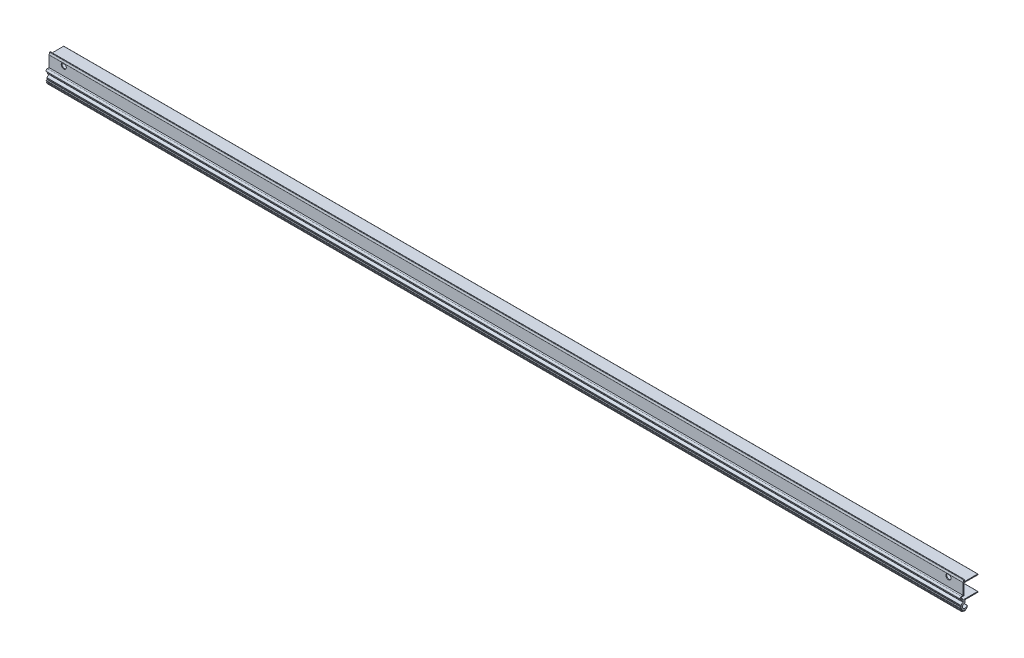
from build123d import *

# Parameters (mm, degrees)
BOSS_EXTRU_1_DEPTH      = 1087
ESQUISSE2_R             = 3
ENL_V_MAT_EXTRU_1_DEPTH = 1088.430514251


with BuildPart() as part:
    # Esquisse1 → Boss.-Extru.1 (new body)
    with BuildSketch(Plane(origin=(0, 0, 0), x_dir=(0, 0, -1), z_dir=(1, 0, 0))):
        with BuildLine():
            Line((17.699361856, -12.657081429), (17.699361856, -12.857081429))
            ThreePointArc((17.699361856, -12.857081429), (17.582204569, -13.139924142), (17.299361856, -13.257081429))
            Line((17.299361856, -13.257081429), (2.1, -13.257081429))
            ThreePointArc((2.1, -13.257081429), (2.029289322, -13.286370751), (2, -13.357081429))
            Line((2, -13.357081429), (2, -16.312578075))
            ThreePointArc((2, -16.312578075), (1.972836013, -16.381097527), (1.906101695, -16.412391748))
            ThreePointArc((1.906101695, -16.412391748), (-0.239398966, -20.913248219), (4.714183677, -20.345004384))
            ThreePointArc((4.714183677, -20.345004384), (4.816537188, -20.283670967), (4.904758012, -20.3640147))
            Line((4.904758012, -20.3640147), (5.057433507, -21.145994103))
            Line((5.057433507, -21.145994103), (4.413912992, -22.987074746))
            ThreePointArc((4.413912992, -22.987074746), (3.693849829, -23.350428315), (2.91955958, -23.576241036))
            ThreePointArc((2.91955958, -23.576241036), (2.829071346, -23.592850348), (2.738255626, -23.607564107))
            ThreePointArc((2.738255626, -23.607564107), (2.712083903, -23.620021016), (2.697221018, -23.644905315))
            Line((2.697221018, -23.644905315), (2.426833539, -24.72937026))
            ThreePointArc((2.426833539, -24.72937026), (2.321661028, -24.892240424), (2.138841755, -24.956777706))
            ThreePointArc((2.138841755, -24.956777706), (2.08, -24.957081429), (2.021158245, -24.956777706))
            ThreePointArc((2.021158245, -24.956777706), (1.838338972, -24.892240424), (1.733166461, -24.72937026))
            Line((1.733166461, -24.72937026), (1.462778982, -23.644905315))
            ThreePointArc((1.462778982, -23.644905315), (1.447916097, -23.620021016), (1.421744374, -23.607564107))
            ThreePointArc((1.421744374, -23.607564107), (1.330928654, -23.592850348), (1.24044042, -23.576241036))
            ThreePointArc((1.24044042, -23.576241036), (1.150319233, -23.557743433), (1.060604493, -23.537365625))
            ThreePointArc((1.060604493, -23.537365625), (1.031672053, -23.53911137), (1.008569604, -23.556615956))
            Line((1.008569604, -23.556615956), (0.35162298, -24.460825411))
            ThreePointArc((0.35162298, -24.460825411), (0.193096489, -24.572437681), (-0.00058668, -24.563790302))
            ThreePointArc((-0.00058668, -24.563790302), (-0.055257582, -24.5420294), (-0.109700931, -24.519705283))
            ThreePointArc((-0.109700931, -24.519705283), (-0.255031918, -24.391382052), (-0.291533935, -24.20097315))
            Line((-0.291533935, -24.20097315), (-0.135985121, -23.09418583))
            ThreePointArc((-0.135985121, -23.09418583), (-0.140443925, -23.065545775), (-0.160043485, -23.04419183))
            ThreePointArc((-0.160043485, -23.04419183), (-0.238734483, -22.996529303), (-0.316411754, -22.947231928))
            ThreePointArc((-0.316411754, -22.947231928), (-0.393041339, -22.896321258), (-0.468589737, -22.843819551))
            ThreePointArc((-0.468589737, -22.843819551), (-0.496069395, -22.834599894), (-0.524046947, -22.842175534))
            Line((-0.524046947, -22.842175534), (-1.471880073, -23.434447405))
            ThreePointArc((-1.471880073, -23.434447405), (-1.660673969, -23.478547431), (-1.837014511, -23.397974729))
            ThreePointArc((-1.837014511, -23.397974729), (-1.879552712, -23.357318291), (-1.921668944, -23.316224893))
            ThreePointArc((-1.921668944, -23.316224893), (-2.00834676, -23.142803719), (-1.970862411, -22.952585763))
            Line((-1.970862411, -22.952585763), (-1.412030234, -21.984660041))
            ThreePointArc((-1.412030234, -21.984660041), (-1.405435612, -21.956435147), (-1.415608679, -21.929293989))
            ThreePointArc((-1.415608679, -21.929293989), (-1.470715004, -21.855623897), (-1.524268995, -21.780817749))
            ThreePointArc((-1.524268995, -21.780817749), (-1.576247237, -21.70490825), (-1.626627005, -21.627928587))
            ThreePointArc((-1.626627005, -21.627928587), (-1.648651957, -21.609086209), (-1.677430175, -21.605629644))
            Line((-1.677430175, -21.605629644), (-2.778114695, -21.799710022))
            ThreePointArc((-2.778114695, -21.799710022), (-2.969681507, -21.769875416), (-3.102998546, -21.629111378))
            ThreePointArc((-3.102998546, -21.629111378), (-3.127209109, -21.575480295), (-3.150864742, -21.521602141))
            ThreePointArc((-3.150864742, -21.521602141), (-3.166266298, -21.328338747), (-3.060254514, -21.166013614))
            Line((-3.060254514, -21.166013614), (-2.179522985, -20.47791073))
            ThreePointArc((-2.179522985, -20.47791073), (-2.162835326, -20.454211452), (-2.162100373, -20.425235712))
            ThreePointArc((-2.162100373, -20.425235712), (-2.185596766, -20.336286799), (-2.207228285, -20.246866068))
            ThreePointArc((-2.207228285, -20.246866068), (-2.226985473, -20.157012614), (-2.244859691, -20.06676572))
            ThreePointArc((-2.244859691, -20.06676572), (-2.258222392, -20.041044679), (-2.28361024, -20.027059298))
            Line((-2.28361024, -20.027059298), (-3.376850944, -19.794683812))
            ThreePointArc((-3.376850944, -19.794683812), (-3.54329236, -19.695259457), (-3.614170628, -19.514803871))
            ThreePointArc((-3.614170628, -19.514803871), (-3.616527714, -19.45600856), (-3.618277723, -19.39719205))
            ThreePointArc((-3.618277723, -19.39719205), (-3.560160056, -19.212231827), (-3.401059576, -19.101439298))
            Line((-3.401059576, -19.101439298), (-3.013010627, -18.990168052))
            Line((-3.013010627, -18.990168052), (-2.358614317, -18.80252293))
            ThreePointArc((-2.358614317, -18.80252293), (-2.310153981, -18.771360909), (-2.286929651, -18.718634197))
            ThreePointArc((-2.286929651, -18.718634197), (-2.277023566, -18.64361126), (-2.265828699, -18.568769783))
            ThreePointArc((-2.265828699, -18.568769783), (-2.257774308, -18.519711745), (-2.249166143, -18.470747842))
            ThreePointArc((-2.249166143, -18.470747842), (-2.241131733, -18.38525084), (-2.247845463, -18.299640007))
            Line((-2.247845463, -18.299640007), (-2.443214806, -17.120825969))
            ThreePointArc((-2.443214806, -17.120825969), (-2.442782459, -16.954755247), (-2.387980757, -16.797986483))
            ThreePointArc((-2.387980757, -16.797986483), (-1.396838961, -15.525916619), (-0.058076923, -14.626894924))
            ThreePointArc((-0.058076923, -14.626894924), (-0.015761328, -14.5899943), (0, -14.536106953))
            Line((0, -14.536106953), (0, -13.357081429))
            ThreePointArc((0, -13.357081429), (-0.029289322, -13.286370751), (-0.1, -13.257081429))
            Line((-0.1, -13.257081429), (-1.22, -13.257081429))
            ThreePointArc((-1.22, -13.257081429), (-1.714974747, -13.052056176), (-1.92, -12.557081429))
            Line((-1.92, -12.557081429), (-1.92, -11.166256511))
            ThreePointArc((-1.92, -11.166256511), (-2.009900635, -10.913593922), (-2.239191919, -10.77450397))
            ThreePointArc((-2.239191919, -10.77450397), (-3.491834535, -9.06665639), (-1.92, -7.647081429))
            Line((-1.92, -7.647081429), (0, -7.647081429))
            Line((0, -7.647081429), (0, 5.467802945))
            ThreePointArc((0, 5.467802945), (0.003422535, 5.520017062), (0.01363157, 5.571337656))
            Line((0.01363157, 5.571337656), (0.623291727, 7.846453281))
            ThreePointArc((0.623291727, 7.846453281), (0.766158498, 8.060262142), (1.009660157, 8.142918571))
            Line((1.009660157, 8.142918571), (1.216716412, 8.142918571))
            ThreePointArc((1.216716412, 8.142918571), (1.534059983, 7.98642023), (1.603084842, 7.63938386))
            Line((1.603084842, 7.63938386), (1.229822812, 6.246453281))
            ThreePointArc((1.229822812, 6.246453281), (1.298847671, 5.899416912), (1.616191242, 5.742918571))
            Line((1.616191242, 5.742918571), (17.299361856, 5.742918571))
            ThreePointArc((17.299361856, 5.742918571), (17.582204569, 5.625761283), (17.699361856, 5.342918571))
            Line((17.699361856, 5.342918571), (17.699361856, 5.142918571))
            ThreePointArc((17.699361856, 5.142918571), (17.582204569, 4.860075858), (17.299361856, 4.742918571))
            Line((17.299361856, 4.742918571), (1.4, 4.742918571))
            ThreePointArc((1.4, 4.742918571), (1.117157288, 4.625761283), (1, 4.342918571))
            Line((1, 4.342918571), (1, -8.495667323))
            Line((1, -8.495667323), (0, -8.495667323))
            Line((0, -8.495667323), (-1.92, -8.495667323))
            ThreePointArc((-1.92, -8.495667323), (-2.651414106, -9.227081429), (-1.92, -9.958495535))
            Line((-1.92, -9.958495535), (-1.82, -9.958495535))
            ThreePointArc((-1.82, -9.958495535), (-1.183603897, -10.222099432), (-0.92, -10.858495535))
            Line((-0.92, -10.858495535), (-0.92, -11.857081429))
            ThreePointArc((-0.92, -11.857081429), (-0.802842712, -12.139924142), (-0.52, -12.257081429))
            Line((-0.52, -12.257081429), (0, -12.257081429))
            Line((0, -12.257081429), (0.999361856, -12.257081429))
            Line((0.999361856, -12.257081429), (17.299361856, -12.257081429))
            ThreePointArc((17.299361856, -12.257081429), (17.582204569, -12.374238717), (17.699361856, -12.657081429))
        make_face()
    extrude(amount=BOSS_EXTRU_1_DEPTH)

    # Esquisse2 → Enl_v. mat.-Extru.1 (cut, through all)
    with BuildSketch(Plane.XY):
        with Locations(Location((17.5, 2.642918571, 0), (0, 0, 34.518107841))):
            Circle(ESQUISSE2_R)
        with Locations(Location((1069.5, 2.642918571, 0), (0, 0, 34.518107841))):
            Circle(ESQUISSE2_R)
    extrude(amount=-ENL_V_MAT_EXTRU_1_DEPTH, mode=Mode.SUBTRACT)


solid = part.part
